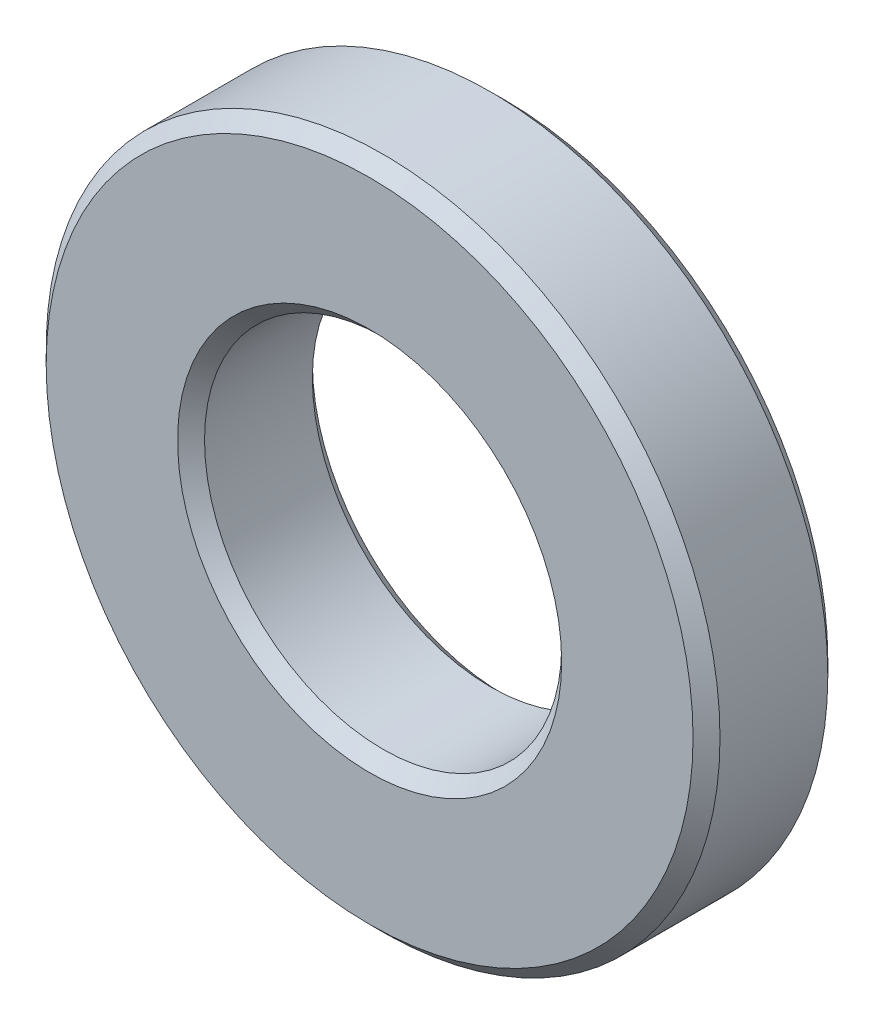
ISO-10303-21;
HEADER;
FILE_DESCRIPTION(('STEP AP214'),'2;1');
FILE_NAME('part.step','',(''),(''),'','','');
FILE_SCHEMA(('AUTOMOTIVE_DESIGN { 1 0 10303 214 1 1 1 1 }'));
ENDSEC;
DATA;
#1=APPLICATION_CONTEXT('core data for automotive mechanical design processes');
#2=APPLICATION_PROTOCOL_DEFINITION('international standard','automotive_design',2000,#1);
#3=PRODUCT_CONTEXT('',#1,'mechanical');
#4=PRODUCT('Part','Part','',(#3));
#5=PRODUCT_RELATED_PRODUCT_CATEGORY('part','',(#4));
#6=PRODUCT_DEFINITION_FORMATION('','',#4);
#7=PRODUCT_DEFINITION_CONTEXT('part definition',#1,'design');
#8=PRODUCT_DEFINITION('design','',#6,#7);
#9=PRODUCT_DEFINITION_SHAPE('','',#8);
#10=(LENGTH_UNIT() NAMED_UNIT(*) SI_UNIT(.MILLI.,.METRE.));
#11=(NAMED_UNIT(*) PLANE_ANGLE_UNIT() SI_UNIT($,.RADIAN.));
#12=(NAMED_UNIT(*) SI_UNIT($,.STERADIAN.) SOLID_ANGLE_UNIT());
#13=UNCERTAINTY_MEASURE_WITH_UNIT(LENGTH_MEASURE(1.E-05),#10,'distance_accuracy_value','');
#14=(GEOMETRIC_REPRESENTATION_CONTEXT(3) GLOBAL_UNCERTAINTY_ASSIGNED_CONTEXT((#13)) GLOBAL_UNIT_ASSIGNED_CONTEXT((#10,
#11,#12)) REPRESENTATION_CONTEXT('',''));
#15=CARTESIAN_POINT('',(0.,0.,0.));
#16=DIRECTION('',(0.,0.,1.));
#17=DIRECTION('',(1.,0.,0.));
#18=AXIS2_PLACEMENT_3D('',#15,#16,#17);
#19=CARTESIAN_POINT('',(0.,0.,1.));
#20=DIRECTION('',(0.,0.,1.));
#21=DIRECTION('',(1.,0.,0.));
#22=AXIS2_PLACEMENT_3D('',#19,#20,#21);
#23=PLANE('',#22);
#24=CARTESIAN_POINT('',(0.,0.,1.));
#25=DIRECTION('',(0.,0.,1.));
#26=DIRECTION('',(1.,0.,0.));
#27=AXIS2_PLACEMENT_3D('',#24,#25,#26);
#28=CIRCLE('',#27,2.85);
#29=CARTESIAN_POINT('',(2.85,0.,1.));
#30=VERTEX_POINT('',#29);
#31=EDGE_CURVE('E10',#30,#30,#28,.F.);
#32=ORIENTED_EDGE('',*,*,#31,.T.);
#33=EDGE_LOOP('',(#32));
#34=FACE_BOUND('',#33,.T.);
#35=CARTESIAN_POINT('',(0.,0.,1.));
#36=DIRECTION('',(0.,0.,1.));
#37=DIRECTION('',(1.,0.,0.));
#38=AXIS2_PLACEMENT_3D('',#35,#36,#37);
#39=CIRCLE('',#38,4.8);
#40=CARTESIAN_POINT('',(4.8,0.,1.));
#41=VERTEX_POINT('',#40);
#42=EDGE_CURVE('E45',#41,#41,#39,.T.);
#43=ORIENTED_EDGE('',*,*,#42,.T.);
#44=EDGE_LOOP('',(#43));
#45=FACE_BOUND('',#44,.T.);
#46=ADVANCED_FACE('F37',(#34,#45),#23,.T.);
#47=CARTESIAN_POINT('',(0.,0.,-1.));
#48=DIRECTION('',(0.,0.,1.));
#49=DIRECTION('',(1.,0.,0.));
#50=AXIS2_PLACEMENT_3D('',#47,#48,#49);
#51=PLANE('',#50);
#52=CARTESIAN_POINT('',(0.,0.,-1.));
#53=DIRECTION('',(0.,0.,1.));
#54=DIRECTION('',(1.,0.,0.));
#55=AXIS2_PLACEMENT_3D('',#52,#53,#54);
#56=CIRCLE('',#55,4.8);
#57=CARTESIAN_POINT('',(4.8,0.,-1.));
#58=VERTEX_POINT('',#57);
#59=EDGE_CURVE('E63',#58,#58,#56,.F.);
#60=ORIENTED_EDGE('',*,*,#59,.T.);
#61=EDGE_LOOP('',(#60));
#62=FACE_BOUND('',#61,.T.);
#63=CARTESIAN_POINT('',(0.,0.,-1.));
#64=DIRECTION('',(0.,0.,1.));
#65=DIRECTION('',(1.,0.,0.));
#66=AXIS2_PLACEMENT_3D('',#63,#64,#65);
#67=CIRCLE('',#66,2.85);
#68=CARTESIAN_POINT('',(-2.85,0.,-1.));
#69=VERTEX_POINT('',#68);
#70=EDGE_CURVE('E66',#69,#69,#67,.T.);
#71=ORIENTED_EDGE('',*,*,#70,.T.);
#72=EDGE_LOOP('',(#71));
#73=FACE_BOUND('',#72,.T.);
#74=ADVANCED_FACE('F89',(#62,#73),#51,.F.);
#75=CARTESIAN_POINT('',(0.,0.,1.));
#76=DIRECTION('',(0.,0.,-1.));
#77=DIRECTION('',(-1.,0.,0.));
#78=AXIS2_PLACEMENT_3D('',#75,#76,#77);
#79=CYLINDRICAL_SURFACE('',#78,5.);
#80=CARTESIAN_POINT('',(0.,0.,-0.8));
#81=DIRECTION('',(0.,0.,1.));
#82=DIRECTION('',(1.,0.,0.));
#83=AXIS2_PLACEMENT_3D('',#80,#81,#82);
#84=CIRCLE('',#83,5.);
#85=CARTESIAN_POINT('',(5.,0.,-0.8));
#86=VERTEX_POINT('',#85);
#87=EDGE_CURVE('E70',#86,#86,#84,.T.);
#88=ORIENTED_EDGE('',*,*,#87,.T.);
#89=EDGE_LOOP('',(#88));
#90=FACE_BOUND('',#89,.T.);
#91=CARTESIAN_POINT('',(0.,0.,0.800000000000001));
#92=DIRECTION('',(0.,0.,1.));
#93=DIRECTION('',(1.,0.,0.));
#94=AXIS2_PLACEMENT_3D('',#91,#92,#93);
#95=CIRCLE('',#94,5.);
#96=CARTESIAN_POINT('',(5.,0.,0.800000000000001));
#97=VERTEX_POINT('',#96);
#98=EDGE_CURVE('E73',#97,#97,#95,.F.);
#99=ORIENTED_EDGE('',*,*,#98,.T.);
#100=EDGE_LOOP('',(#99));
#101=FACE_BOUND('',#100,.T.);
#102=ADVANCED_FACE('F78',(#90,#101),#79,.T.);
#103=CARTESIAN_POINT('',(0.,0.,1.));
#104=DIRECTION('',(0.,0.,-1.));
#105=DIRECTION('',(-1.,0.,0.));
#106=AXIS2_PLACEMENT_3D('',#103,#104,#105);
#107=CYLINDRICAL_SURFACE('',#106,2.65);
#108=CARTESIAN_POINT('',(0.,0.,-0.8));
#109=DIRECTION('',(0.,0.,1.));
#110=DIRECTION('',(1.,0.,0.));
#111=AXIS2_PLACEMENT_3D('',#108,#109,#110);
#112=CIRCLE('',#111,2.65);
#113=CARTESIAN_POINT('',(-2.65,0.,-0.8));
#114=VERTEX_POINT('',#113);
#115=EDGE_CURVE('E52',#114,#114,#112,.F.);
#116=ORIENTED_EDGE('',*,*,#115,.T.);
#117=EDGE_LOOP('',(#116));
#118=FACE_BOUND('',#117,.T.);
#119=CARTESIAN_POINT('',(0.,0.,0.800000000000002));
#120=DIRECTION('',(0.,0.,1.));
#121=DIRECTION('',(1.,0.,0.));
#122=AXIS2_PLACEMENT_3D('',#119,#120,#121);
#123=CIRCLE('',#122,2.65);
#124=CARTESIAN_POINT('',(2.65,0.,0.800000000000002));
#125=VERTEX_POINT('',#124);
#126=EDGE_CURVE('E58',#125,#125,#123,.T.);
#127=ORIENTED_EDGE('',*,*,#126,.T.);
#128=EDGE_LOOP('',(#127));
#129=FACE_BOUND('',#128,.T.);
#130=ADVANCED_FACE('F97',(#118,#129),#107,.F.);
#131=CARTESIAN_POINT('',(0.,0.,-0.8));
#132=DIRECTION('',(0.,0.,1.));
#133=DIRECTION('',(1.,0.,0.));
#134=AXIS2_PLACEMENT_3D('',#131,#132,#133);
#135=CONICAL_SURFACE('',#134,5.,0.785398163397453);
#136=CARTESIAN_POINT('',(4.8,0.,-1.));
#137=CARTESIAN_POINT('',(4.80208333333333,0.,-0.997916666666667));
#138=CARTESIAN_POINT('',(4.80416666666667,0.,-0.995833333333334));
#139=CARTESIAN_POINT('',(4.80833333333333,0.,-0.991666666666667));
#140=CARTESIAN_POINT('',(4.81041666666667,0.,-0.989583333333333));
#141=CARTESIAN_POINT('',(4.81458333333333,0.,-0.985416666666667));
#142=CARTESIAN_POINT('',(4.81666666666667,0.,-0.983333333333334));
#143=CARTESIAN_POINT('',(4.82083333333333,0.,-0.979166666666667));
#144=CARTESIAN_POINT('',(4.82291666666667,0.,-0.977083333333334));
#145=CARTESIAN_POINT('',(4.82708333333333,0.,-0.972916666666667));
#146=CARTESIAN_POINT('',(4.82916666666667,0.,-0.970833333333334));
#147=CARTESIAN_POINT('',(4.83333333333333,0.,-0.966666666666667));
#148=CARTESIAN_POINT('',(4.83541666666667,0.,-0.964583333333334));
#149=CARTESIAN_POINT('',(4.83958333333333,0.,-0.960416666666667));
#150=CARTESIAN_POINT('',(4.84166666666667,0.,-0.958333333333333));
#151=CARTESIAN_POINT('',(4.84583333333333,0.,-0.954166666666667));
#152=CARTESIAN_POINT('',(4.84791666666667,0.,-0.952083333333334));
#153=CARTESIAN_POINT('',(4.85208333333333,0.,-0.947916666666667));
#154=CARTESIAN_POINT('',(4.85416666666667,0.,-0.945833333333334));
#155=CARTESIAN_POINT('',(4.85833333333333,0.,-0.941666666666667));
#156=CARTESIAN_POINT('',(4.86041666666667,0.,-0.939583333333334));
#157=CARTESIAN_POINT('',(4.86458333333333,0.,-0.935416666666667));
#158=CARTESIAN_POINT('',(4.86666666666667,0.,-0.933333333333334));
#159=CARTESIAN_POINT('',(4.87083333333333,0.,-0.929166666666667));
#160=CARTESIAN_POINT('',(4.87291666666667,0.,-0.927083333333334));
#161=CARTESIAN_POINT('',(4.87708333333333,0.,-0.922916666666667));
#162=CARTESIAN_POINT('',(4.87916666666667,0.,-0.920833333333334));
#163=CARTESIAN_POINT('',(4.88333333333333,0.,-0.916666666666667));
#164=CARTESIAN_POINT('',(4.88541666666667,0.,-0.914583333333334));
#165=CARTESIAN_POINT('',(4.88958333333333,0.,-0.910416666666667));
#166=CARTESIAN_POINT('',(4.89166666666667,0.,-0.908333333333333));
#167=CARTESIAN_POINT('',(4.89583333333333,0.,-0.904166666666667));
#168=CARTESIAN_POINT('',(4.89791666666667,0.,-0.902083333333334));
#169=CARTESIAN_POINT('',(4.90208333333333,0.,-0.897916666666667));
#170=CARTESIAN_POINT('',(4.90416666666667,0.,-0.895833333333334));
#171=CARTESIAN_POINT('',(4.90833333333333,0.,-0.891666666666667));
#172=CARTESIAN_POINT('',(4.91041666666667,0.,-0.889583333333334));
#173=CARTESIAN_POINT('',(4.91458333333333,0.,-0.885416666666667));
#174=CARTESIAN_POINT('',(4.91666666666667,0.,-0.883333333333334));
#175=CARTESIAN_POINT('',(4.92083333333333,0.,-0.879166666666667));
#176=CARTESIAN_POINT('',(4.92291666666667,0.,-0.877083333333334));
#177=CARTESIAN_POINT('',(4.92708333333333,0.,-0.872916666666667));
#178=CARTESIAN_POINT('',(4.92916666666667,0.,-0.870833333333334));
#179=CARTESIAN_POINT('',(4.93333333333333,0.,-0.866666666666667));
#180=CARTESIAN_POINT('',(4.93541666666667,0.,-0.864583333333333));
#181=CARTESIAN_POINT('',(4.93958333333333,0.,-0.860416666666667));
#182=CARTESIAN_POINT('',(4.94166666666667,0.,-0.858333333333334));
#183=CARTESIAN_POINT('',(4.94583333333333,0.,-0.854166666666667));
#184=CARTESIAN_POINT('',(4.94791666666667,0.,-0.852083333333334));
#185=CARTESIAN_POINT('',(4.95208333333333,0.,-0.847916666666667));
#186=CARTESIAN_POINT('',(4.95416666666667,0.,-0.845833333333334));
#187=CARTESIAN_POINT('',(4.95833333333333,0.,-0.841666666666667));
#188=CARTESIAN_POINT('',(4.96041666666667,0.,-0.839583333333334));
#189=CARTESIAN_POINT('',(4.96458333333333,0.,-0.835416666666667));
#190=CARTESIAN_POINT('',(4.96666666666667,0.,-0.833333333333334));
#191=CARTESIAN_POINT('',(4.97083333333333,0.,-0.829166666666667));
#192=CARTESIAN_POINT('',(4.97291666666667,0.,-0.827083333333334));
#193=CARTESIAN_POINT('',(4.97708333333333,0.,-0.822916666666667));
#194=CARTESIAN_POINT('',(4.97916666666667,0.,-0.820833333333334));
#195=CARTESIAN_POINT('',(4.98333333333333,0.,-0.816666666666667));
#196=CARTESIAN_POINT('',(4.98541666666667,0.,-0.814583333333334));
#197=CARTESIAN_POINT('',(4.98958333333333,0.,-0.810416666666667));
#198=CARTESIAN_POINT('',(4.99166666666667,0.,-0.808333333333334));
#199=CARTESIAN_POINT('',(4.99583333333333,0.,-0.804166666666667));
#200=CARTESIAN_POINT('',(4.99791666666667,0.,-0.802083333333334));
#201=CARTESIAN_POINT('',(5.,0.,-0.8));
#202=B_SPLINE_CURVE_WITH_KNOTS('',3,(#136,#137,#138,#139,#140,#141,#142,#143,#144,#145,#146,
#147,#148,#149,#150,#151,#152,#153,#154,#155,#156,#157,#158,#159,#160,#161,#162,#163,#164,#165,
#166,#167,#168,#169,#170,#171,#172,#173,#174,#175,#176,#177,#178,#179,#180,#181,#182,#183,#184,
#185,#186,#187,#188,#189,#190,#191,#192,#193,#194,#195,#196,#197,#198,#199,#200,#201),
.UNSPECIFIED.,.F.,.F.,(4,2,2,2,2,2,2,2,2,2,2,2,2,2,2,2,2,2,2,2,2,2,2,2,2,2,2,2,2,2,2,2,4),(0.,
0.00883883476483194,0.0176776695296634,0.0265165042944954,0.0353553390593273,0.0441941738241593,
0.0530330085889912,0.0618718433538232,0.0707106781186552,0.0795495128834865,0.0883883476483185,
0.0972271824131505,0.106066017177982,0.114904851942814,0.123743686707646,0.132582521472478,
0.14142135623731,0.150260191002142,0.159099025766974,0.167937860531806,0.176776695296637,
0.185615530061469,0.194454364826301,0.203293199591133,0.212132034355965,0.220970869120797,
0.229809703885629,0.238648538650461,0.247487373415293,0.256326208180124,0.265165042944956,
0.274003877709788,0.28284271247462),.UNSPECIFIED.);
#203=EDGE_CURVE('BSEAM102',#58,#86,#202,.T.);
#204=ORIENTED_EDGE('',*,*,#59,.F.);
#205=ORIENTED_EDGE('',*,*,#87,.F.);
#206=ORIENTED_EDGE('',*,*,#203,.T.);
#207=ORIENTED_EDGE('',*,*,#203,.F.);
#208=EDGE_LOOP('',(#204,#206,#205,#207));
#209=FACE_BOUND('',#208,.T.);
#210=ADVANCED_FACE('F102',(#209),#135,.T.);
#211=CARTESIAN_POINT('',(0.,0.,-1.));
#212=DIRECTION('',(0.,0.,-1.));
#213=DIRECTION('',(-1.,0.,0.));
#214=AXIS2_PLACEMENT_3D('',#211,#212,#213);
#215=CONICAL_SURFACE('',#214,2.85,0.785398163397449);
#216=CARTESIAN_POINT('',(-2.65,0.,-0.8));
#217=CARTESIAN_POINT('',(-2.65208333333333,0.,-0.802083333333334));
#218=CARTESIAN_POINT('',(-2.65416666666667,0.,-0.804166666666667));
#219=CARTESIAN_POINT('',(-2.65833333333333,0.,-0.808333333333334));
#220=CARTESIAN_POINT('',(-2.66041666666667,0.,-0.810416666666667));
#221=CARTESIAN_POINT('',(-2.66458333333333,0.,-0.814583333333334));
#222=CARTESIAN_POINT('',(-2.66666666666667,0.,-0.816666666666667));
#223=CARTESIAN_POINT('',(-2.67083333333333,0.,-0.820833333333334));
#224=CARTESIAN_POINT('',(-2.67291666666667,0.,-0.822916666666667));
#225=CARTESIAN_POINT('',(-2.67708333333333,0.,-0.827083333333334));
#226=CARTESIAN_POINT('',(-2.67916666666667,0.,-0.829166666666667));
#227=CARTESIAN_POINT('',(-2.68333333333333,0.,-0.833333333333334));
#228=CARTESIAN_POINT('',(-2.68541666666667,0.,-0.835416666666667));
#229=CARTESIAN_POINT('',(-2.68958333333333,0.,-0.839583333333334));
#230=CARTESIAN_POINT('',(-2.69166666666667,0.,-0.841666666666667));
#231=CARTESIAN_POINT('',(-2.69583333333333,0.,-0.845833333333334));
#232=CARTESIAN_POINT('',(-2.69791666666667,0.,-0.847916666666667));
#233=CARTESIAN_POINT('',(-2.70208333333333,0.,-0.852083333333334));
#234=CARTESIAN_POINT('',(-2.70416666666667,0.,-0.854166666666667));
#235=CARTESIAN_POINT('',(-2.70833333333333,0.,-0.858333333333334));
#236=CARTESIAN_POINT('',(-2.71041666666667,0.,-0.860416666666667));
#237=CARTESIAN_POINT('',(-2.71458333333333,0.,-0.864583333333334));
#238=CARTESIAN_POINT('',(-2.71666666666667,0.,-0.866666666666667));
#239=CARTESIAN_POINT('',(-2.72083333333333,0.,-0.870833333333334));
#240=CARTESIAN_POINT('',(-2.72291666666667,0.,-0.872916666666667));
#241=CARTESIAN_POINT('',(-2.72708333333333,0.,-0.877083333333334));
#242=CARTESIAN_POINT('',(-2.72916666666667,0.,-0.879166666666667));
#243=CARTESIAN_POINT('',(-2.73333333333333,0.,-0.883333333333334));
#244=CARTESIAN_POINT('',(-2.73541666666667,0.,-0.885416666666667));
#245=CARTESIAN_POINT('',(-2.73958333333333,0.,-0.889583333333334));
#246=CARTESIAN_POINT('',(-2.74166666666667,0.,-0.891666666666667));
#247=CARTESIAN_POINT('',(-2.74583333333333,0.,-0.895833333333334));
#248=CARTESIAN_POINT('',(-2.74791666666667,0.,-0.897916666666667));
#249=CARTESIAN_POINT('',(-2.75208333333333,0.,-0.902083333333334));
#250=CARTESIAN_POINT('',(-2.75416666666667,0.,-0.904166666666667));
#251=CARTESIAN_POINT('',(-2.75833333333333,0.,-0.908333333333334));
#252=CARTESIAN_POINT('',(-2.76041666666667,0.,-0.910416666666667));
#253=CARTESIAN_POINT('',(-2.76458333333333,0.,-0.914583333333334));
#254=CARTESIAN_POINT('',(-2.76666666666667,0.,-0.916666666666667));
#255=CARTESIAN_POINT('',(-2.77083333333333,0.,-0.920833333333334));
#256=CARTESIAN_POINT('',(-2.77291666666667,0.,-0.922916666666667));
#257=CARTESIAN_POINT('',(-2.77708333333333,0.,-0.927083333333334));
#258=CARTESIAN_POINT('',(-2.77916666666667,0.,-0.929166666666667));
#259=CARTESIAN_POINT('',(-2.78333333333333,0.,-0.933333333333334));
#260=CARTESIAN_POINT('',(-2.78541666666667,0.,-0.935416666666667));
#261=CARTESIAN_POINT('',(-2.78958333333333,0.,-0.939583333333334));
#262=CARTESIAN_POINT('',(-2.79166666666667,0.,-0.941666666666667));
#263=CARTESIAN_POINT('',(-2.79583333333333,0.,-0.945833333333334));
#264=CARTESIAN_POINT('',(-2.79791666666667,0.,-0.947916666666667));
#265=CARTESIAN_POINT('',(-2.80208333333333,0.,-0.952083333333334));
#266=CARTESIAN_POINT('',(-2.80416666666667,0.,-0.954166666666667));
#267=CARTESIAN_POINT('',(-2.80833333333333,0.,-0.958333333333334));
#268=CARTESIAN_POINT('',(-2.81041666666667,0.,-0.960416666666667));
#269=CARTESIAN_POINT('',(-2.81458333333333,0.,-0.964583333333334));
#270=CARTESIAN_POINT('',(-2.81666666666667,0.,-0.966666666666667));
#271=CARTESIAN_POINT('',(-2.82083333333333,0.,-0.970833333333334));
#272=CARTESIAN_POINT('',(-2.82291666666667,0.,-0.972916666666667));
#273=CARTESIAN_POINT('',(-2.82708333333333,0.,-0.977083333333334));
#274=CARTESIAN_POINT('',(-2.82916666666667,0.,-0.979166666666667));
#275=CARTESIAN_POINT('',(-2.83333333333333,0.,-0.983333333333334));
#276=CARTESIAN_POINT('',(-2.83541666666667,0.,-0.985416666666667));
#277=CARTESIAN_POINT('',(-2.83958333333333,0.,-0.989583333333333));
#278=CARTESIAN_POINT('',(-2.84166666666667,0.,-0.991666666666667));
#279=CARTESIAN_POINT('',(-2.84583333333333,0.,-0.995833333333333));
#280=CARTESIAN_POINT('',(-2.84791666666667,0.,-0.997916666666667));
#281=CARTESIAN_POINT('',(-2.85,0.,-1.));
#282=B_SPLINE_CURVE_WITH_KNOTS('',3,(#216,#217,#218,#219,#220,#221,#222,#223,#224,#225,#226,
#227,#228,#229,#230,#231,#232,#233,#234,#235,#236,#237,#238,#239,#240,#241,#242,#243,#244,#245,
#246,#247,#248,#249,#250,#251,#252,#253,#254,#255,#256,#257,#258,#259,#260,#261,#262,#263,#264,
#265,#266,#267,#268,#269,#270,#271,#272,#273,#274,#275,#276,#277,#278,#279,#280,#281),
.UNSPECIFIED.,.F.,.F.,(4,2,2,2,2,2,2,2,2,2,2,2,2,2,2,2,2,2,2,2,2,2,2,2,2,2,2,2,2,2,2,2,4),(0.,
0.00883883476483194,0.0176776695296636,0.0265165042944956,0.0353553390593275,0.0441941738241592,
0.0530330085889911,0.0618718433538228,0.0707106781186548,0.0795495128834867,0.0883883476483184,
0.0972271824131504,0.106066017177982,0.114904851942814,0.123743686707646,0.132582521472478,
0.14142135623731,0.150260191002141,0.159099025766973,0.167937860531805,0.176776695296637,
0.185615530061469,0.1944543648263,0.203293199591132,0.212132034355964,0.220970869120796,
0.229809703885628,0.23864853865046,0.247487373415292,0.256326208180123,0.265165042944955,
0.274003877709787,0.282842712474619),.UNSPECIFIED.);
#283=EDGE_CURVE('BSEAM86',#114,#69,#282,.T.);
#284=ORIENTED_EDGE('',*,*,#115,.F.);
#285=ORIENTED_EDGE('',*,*,#70,.F.);
#286=ORIENTED_EDGE('',*,*,#283,.T.);
#287=ORIENTED_EDGE('',*,*,#283,.F.);
#288=EDGE_LOOP('',(#284,#286,#285,#287));
#289=FACE_BOUND('',#288,.T.);
#290=ADVANCED_FACE('F86',(#289),#215,.F.);
#291=CARTESIAN_POINT('',(0.,0.,0.800000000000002));
#292=DIRECTION('',(0.,0.,1.));
#293=DIRECTION('',(1.,0.,0.));
#294=AXIS2_PLACEMENT_3D('',#291,#292,#293);
#295=CONICAL_SURFACE('',#294,2.65,0.785398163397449);
#296=ORIENTED_EDGE('',*,*,#31,.F.);
#297=EDGE_LOOP('',(#296));
#298=FACE_BOUND('',#297,.T.);
#299=ORIENTED_EDGE('',*,*,#126,.F.);
#300=EDGE_LOOP('',(#299));
#301=FACE_BOUND('',#300,.T.);
#302=ADVANCED_FACE('F82',(#298,#301),#295,.F.);
#303=CARTESIAN_POINT('',(0.,0.,1.));
#304=DIRECTION('',(0.,0.,-1.));
#305=DIRECTION('',(-1.,0.,0.));
#306=AXIS2_PLACEMENT_3D('',#303,#304,#305);
#307=CONICAL_SURFACE('',#306,4.8,0.78539816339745);
#308=ORIENTED_EDGE('',*,*,#98,.F.);
#309=EDGE_LOOP('',(#308));
#310=FACE_BOUND('',#309,.T.);
#311=ORIENTED_EDGE('',*,*,#42,.F.);
#312=EDGE_LOOP('',(#311));
#313=FACE_BOUND('',#312,.T.);
#314=ADVANCED_FACE('F39',(#310,#313),#307,.T.);
#315=CLOSED_SHELL('',(#46,#74,#102,#130,#210,#290,#302,#314));
#316=MANIFOLD_SOLID_BREP('B2',#315);
#317=ADVANCED_BREP_SHAPE_REPRESENTATION('',(#18,#316),#14);
#318=SHAPE_DEFINITION_REPRESENTATION(#9,#317);
ENDSEC;
END-ISO-10303-21;
